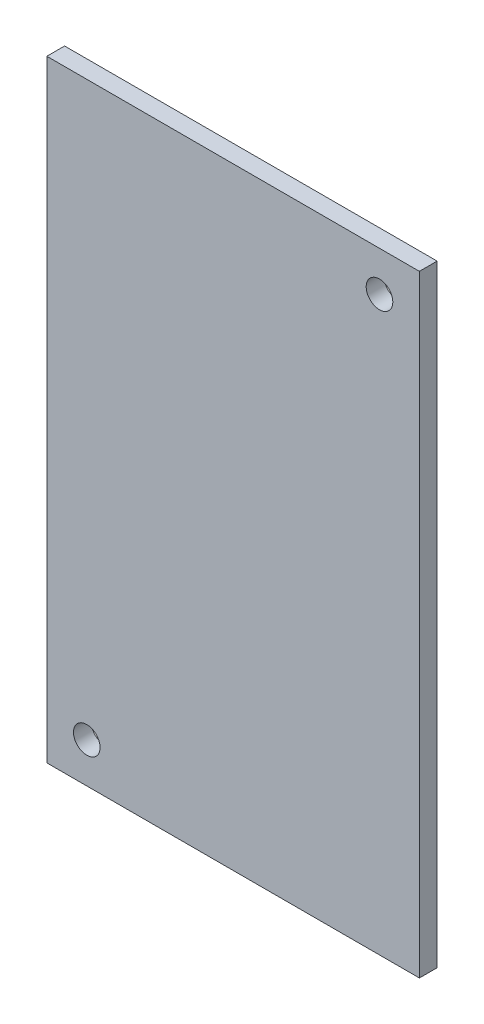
ISO-10303-21;
HEADER;
FILE_DESCRIPTION(('STEP AP214'),'2;1');
FILE_NAME('part.step','',(''),(''),'','','');
FILE_SCHEMA(('AUTOMOTIVE_DESIGN { 1 0 10303 214 1 1 1 1 }'));
ENDSEC;
DATA;
#1=APPLICATION_CONTEXT('core data for automotive mechanical design processes');
#2=APPLICATION_PROTOCOL_DEFINITION('international standard','automotive_design',2000,#1);
#3=PRODUCT_CONTEXT('',#1,'mechanical');
#4=PRODUCT('Part','Part','',(#3));
#5=PRODUCT_RELATED_PRODUCT_CATEGORY('part','',(#4));
#6=PRODUCT_DEFINITION_FORMATION('','',#4);
#7=PRODUCT_DEFINITION_CONTEXT('part definition',#1,'design');
#8=PRODUCT_DEFINITION('design','',#6,#7);
#9=PRODUCT_DEFINITION_SHAPE('','',#8);
#10=(LENGTH_UNIT() NAMED_UNIT(*) SI_UNIT(.MILLI.,.METRE.));
#11=(NAMED_UNIT(*) PLANE_ANGLE_UNIT() SI_UNIT($,.RADIAN.));
#12=(NAMED_UNIT(*) SI_UNIT($,.STERADIAN.) SOLID_ANGLE_UNIT());
#13=UNCERTAINTY_MEASURE_WITH_UNIT(LENGTH_MEASURE(1.E-05),#10,'distance_accuracy_value','');
#14=(GEOMETRIC_REPRESENTATION_CONTEXT(3) GLOBAL_UNCERTAINTY_ASSIGNED_CONTEXT((#13)) GLOBAL_UNIT_ASSIGNED_CONTEXT((#10,
#11,#12)) REPRESENTATION_CONTEXT('',''));
#15=CARTESIAN_POINT('',(0.,0.,0.));
#16=DIRECTION('',(0.,0.,1.));
#17=DIRECTION('',(1.,0.,0.));
#18=AXIS2_PLACEMENT_3D('',#15,#16,#17);
#19=CARTESIAN_POINT('',(0.,0.,61.1925663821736));
#20=DIRECTION('',(0.,0.,1.));
#21=DIRECTION('',(1.,0.,0.));
#22=AXIS2_PLACEMENT_3D('',#19,#20,#21);
#23=PLANE('',#22);
#24=CARTESIAN_POINT('',(58.9525591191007,33.6048244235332,61.1925663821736));
#25=DIRECTION('',(0.,0.,1.));
#26=DIRECTION('',(-1.,0.,0.));
#27=AXIS2_PLACEMENT_3D('',#24,#25,#26);
#28=CIRCLE('',#27,1.5);
#29=CARTESIAN_POINT('',(57.4525591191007,33.6048244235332,61.1925663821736));
#30=VERTEX_POINT('',#29);
#31=EDGE_CURVE('E100',#30,#30,#28,.T.);
#32=ORIENTED_EDGE('',*,*,#31,.F.);
#33=EDGE_LOOP('',(#32));
#34=FACE_BOUND('',#33,.T.);
#35=DIRECTION('',(0.,1.,0.));
#36=VECTOR('',#35,1.);
#37=CARTESIAN_POINT('',(96.4525591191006,98.1048244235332,61.1925663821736));
#38=LINE('',#37,#36);
#39=CARTESIAN_POINT('',(96.4525591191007,29.1048244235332,61.1925663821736));
#40=VERTEX_POINT('',#39);
#41=CARTESIAN_POINT('',(96.4525591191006,98.1048244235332,61.1925663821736));
#42=VERTEX_POINT('',#41);
#43=EDGE_CURVE('E85',#40,#42,#38,.T.);
#44=ORIENTED_EDGE('',*,*,#43,.T.);
#45=DIRECTION('',(-1.,0.,0.));
#46=VECTOR('',#45,1.);
#47=CARTESIAN_POINT('',(54.4525591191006,98.1048244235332,61.1925663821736));
#48=LINE('',#47,#46);
#49=CARTESIAN_POINT('',(54.4525591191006,98.1048244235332,61.1925663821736));
#50=VERTEX_POINT('',#49);
#51=EDGE_CURVE('E80',#42,#50,#48,.T.);
#52=ORIENTED_EDGE('',*,*,#51,.T.);
#53=DIRECTION('',(0.,-1.,0.));
#54=VECTOR('',#53,1.);
#55=CARTESIAN_POINT('',(54.4525591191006,98.1048244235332,61.1925663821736));
#56=LINE('',#55,#54);
#57=CARTESIAN_POINT('',(54.4525591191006,29.1048244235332,61.1925663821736));
#58=VERTEX_POINT('',#57);
#59=EDGE_CURVE('E83',#50,#58,#56,.T.);
#60=ORIENTED_EDGE('',*,*,#59,.T.);
#61=DIRECTION('',(1.,0.,0.));
#62=VECTOR('',#61,1.);
#63=CARTESIAN_POINT('',(54.4525591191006,29.1048244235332,61.1925663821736));
#64=LINE('',#63,#62);
#65=EDGE_CURVE('E50',#58,#40,#64,.T.);
#66=ORIENTED_EDGE('',*,*,#65,.T.);
#67=EDGE_LOOP('',(#44,#52,#60,#66));
#68=FACE_BOUND('',#67,.T.);
#69=CARTESIAN_POINT('',(91.9525591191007,93.6048244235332,61.1925663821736));
#70=DIRECTION('',(0.,0.,1.));
#71=DIRECTION('',(-1.,0.,0.));
#72=AXIS2_PLACEMENT_3D('',#69,#70,#71);
#73=CIRCLE('',#72,1.5);
#74=CARTESIAN_POINT('',(90.4525591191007,93.6048244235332,61.1925663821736));
#75=VERTEX_POINT('',#74);
#76=EDGE_CURVE('E115',#75,#75,#73,.T.);
#77=ORIENTED_EDGE('',*,*,#76,.F.);
#78=EDGE_LOOP('',(#77));
#79=FACE_BOUND('',#78,.T.);
#80=ADVANCED_FACE('F33',(#34,#68,#79),#23,.T.);
#81=CARTESIAN_POINT('',(0.,0.,59.1925663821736));
#82=DIRECTION('',(0.,0.,1.));
#83=DIRECTION('',(1.,0.,0.));
#84=AXIS2_PLACEMENT_3D('',#81,#82,#83);
#85=PLANE('',#84);
#86=DIRECTION('',(0.,1.,0.));
#87=VECTOR('',#86,1.);
#88=CARTESIAN_POINT('',(96.4525591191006,98.1048244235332,59.1925663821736));
#89=LINE('',#88,#87);
#90=CARTESIAN_POINT('',(96.4525591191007,29.1048244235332,59.1925663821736));
#91=VERTEX_POINT('',#90);
#92=CARTESIAN_POINT('',(96.4525591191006,98.1048244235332,59.1925663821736));
#93=VERTEX_POINT('',#92);
#94=EDGE_CURVE('E97',#91,#93,#89,.T.);
#95=ORIENTED_EDGE('',*,*,#94,.F.);
#96=DIRECTION('',(1.,0.,0.));
#97=VECTOR('',#96,1.);
#98=CARTESIAN_POINT('',(54.4525591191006,29.1048244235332,59.1925663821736));
#99=LINE('',#98,#97);
#100=CARTESIAN_POINT('',(54.4525591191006,29.1048244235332,59.1925663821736));
#101=VERTEX_POINT('',#100);
#102=EDGE_CURVE('E73',#101,#91,#99,.T.);
#103=ORIENTED_EDGE('',*,*,#102,.F.);
#104=DIRECTION('',(0.,-1.,0.));
#105=VECTOR('',#104,1.);
#106=CARTESIAN_POINT('',(54.4525591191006,98.1048244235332,59.1925663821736));
#107=LINE('',#106,#105);
#108=CARTESIAN_POINT('',(54.4525591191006,98.1048244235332,59.1925663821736));
#109=VERTEX_POINT('',#108);
#110=EDGE_CURVE('E67',#109,#101,#107,.T.);
#111=ORIENTED_EDGE('',*,*,#110,.F.);
#112=DIRECTION('',(-1.,0.,0.));
#113=VECTOR('',#112,1.);
#114=CARTESIAN_POINT('',(54.4525591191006,98.1048244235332,59.1925663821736));
#115=LINE('',#114,#113);
#116=EDGE_CURVE('E89',#93,#109,#115,.T.);
#117=ORIENTED_EDGE('',*,*,#116,.F.);
#118=EDGE_LOOP('',(#95,#103,#111,#117));
#119=FACE_BOUND('',#118,.T.);
#120=CARTESIAN_POINT('',(58.9525591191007,33.6048244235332,59.1925663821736));
#121=DIRECTION('',(0.,0.,1.));
#122=DIRECTION('',(-1.,0.,0.));
#123=AXIS2_PLACEMENT_3D('',#120,#121,#122);
#124=CIRCLE('',#123,1.5);
#125=CARTESIAN_POINT('',(57.4525591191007,33.6048244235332,59.1925663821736));
#126=VERTEX_POINT('',#125);
#127=EDGE_CURVE('E112',#126,#126,#124,.T.);
#128=ORIENTED_EDGE('',*,*,#127,.T.);
#129=EDGE_LOOP('',(#128));
#130=FACE_BOUND('',#129,.T.);
#131=CARTESIAN_POINT('',(91.9525591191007,93.6048244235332,59.1925663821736));
#132=DIRECTION('',(0.,0.,1.));
#133=DIRECTION('',(-1.,0.,0.));
#134=AXIS2_PLACEMENT_3D('',#131,#132,#133);
#135=CIRCLE('',#134,1.5);
#136=CARTESIAN_POINT('',(90.4525591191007,93.6048244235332,59.1925663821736));
#137=VERTEX_POINT('',#136);
#138=EDGE_CURVE('E118',#137,#137,#135,.T.);
#139=ORIENTED_EDGE('',*,*,#138,.T.);
#140=EDGE_LOOP('',(#139));
#141=FACE_BOUND('',#140,.T.);
#142=ADVANCED_FACE('F108',(#119,#130,#141),#85,.F.);
#143=CARTESIAN_POINT('',(96.4525591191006,98.1048244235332,61.1925663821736));
#144=DIRECTION('',(-1.,0.,0.));
#145=DIRECTION('',(0.,-1.,0.));
#146=AXIS2_PLACEMENT_3D('',#143,#144,#145);
#147=PLANE('',#146);
#148=ORIENTED_EDGE('',*,*,#94,.T.);
#149=DIRECTION('',(0.,0.,-1.));
#150=VECTOR('',#149,1.);
#151=CARTESIAN_POINT('',(96.4525591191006,98.1048244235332,61.1925663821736));
#152=LINE('',#151,#150);
#153=EDGE_CURVE('E11',#42,#93,#152,.T.);
#154=ORIENTED_EDGE('',*,*,#153,.F.);
#155=ORIENTED_EDGE('',*,*,#43,.F.);
#156=DIRECTION('',(0.,0.,-1.));
#157=VECTOR('',#156,1.);
#158=CARTESIAN_POINT('',(96.4525591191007,29.1048244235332,61.1925663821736));
#159=LINE('',#158,#157);
#160=EDGE_CURVE('E93',#40,#91,#159,.T.);
#161=ORIENTED_EDGE('',*,*,#160,.T.);
#162=EDGE_LOOP('',(#148,#154,#155,#161));
#163=FACE_BOUND('',#162,.T.);
#164=ADVANCED_FACE('F35',(#163),#147,.F.);
#165=CARTESIAN_POINT('',(54.4525591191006,98.1048244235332,61.1925663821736));
#166=DIRECTION('',(0.,-1.,0.));
#167=DIRECTION('',(0.,0.,-1.));
#168=AXIS2_PLACEMENT_3D('',#165,#166,#167);
#169=PLANE('',#168);
#170=ORIENTED_EDGE('',*,*,#116,.T.);
#171=DIRECTION('',(0.,0.,-1.));
#172=VECTOR('',#171,1.);
#173=CARTESIAN_POINT('',(54.4525591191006,98.1048244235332,61.1925663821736));
#174=LINE('',#173,#172);
#175=EDGE_CURVE('E42',#50,#109,#174,.T.);
#176=ORIENTED_EDGE('',*,*,#175,.F.);
#177=ORIENTED_EDGE('',*,*,#51,.F.);
#178=ORIENTED_EDGE('',*,*,#153,.T.);
#179=EDGE_LOOP('',(#170,#176,#177,#178));
#180=FACE_BOUND('',#179,.T.);
#181=ADVANCED_FACE('F88',(#180),#169,.F.);
#182=CARTESIAN_POINT('',(54.4525591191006,98.1048244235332,61.1925663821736));
#183=DIRECTION('',(1.,0.,0.));
#184=DIRECTION('',(0.,0.,-1.));
#185=AXIS2_PLACEMENT_3D('',#182,#183,#184);
#186=PLANE('',#185);
#187=ORIENTED_EDGE('',*,*,#110,.T.);
#188=DIRECTION('',(0.,0.,-1.));
#189=VECTOR('',#188,1.);
#190=CARTESIAN_POINT('',(54.4525591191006,29.1048244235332,61.1925663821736));
#191=LINE('',#190,#189);
#192=EDGE_CURVE('E90',#58,#101,#191,.T.);
#193=ORIENTED_EDGE('',*,*,#192,.F.);
#194=ORIENTED_EDGE('',*,*,#59,.F.);
#195=ORIENTED_EDGE('',*,*,#175,.T.);
#196=EDGE_LOOP('',(#187,#193,#194,#195));
#197=FACE_BOUND('',#196,.T.);
#198=ADVANCED_FACE('F91',(#197),#186,.F.);
#199=CARTESIAN_POINT('',(54.4525591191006,29.1048244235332,61.1925663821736));
#200=DIRECTION('',(0.,1.,0.));
#201=DIRECTION('',(0.,0.,1.));
#202=AXIS2_PLACEMENT_3D('',#199,#200,#201);
#203=PLANE('',#202);
#204=ORIENTED_EDGE('',*,*,#102,.T.);
#205=ORIENTED_EDGE('',*,*,#160,.F.);
#206=ORIENTED_EDGE('',*,*,#65,.F.);
#207=ORIENTED_EDGE('',*,*,#192,.T.);
#208=EDGE_LOOP('',(#204,#205,#206,#207));
#209=FACE_BOUND('',#208,.T.);
#210=ADVANCED_FACE('F105',(#209),#203,.F.);
#211=CARTESIAN_POINT('',(58.9525591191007,33.6048244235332,61.1925663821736));
#212=DIRECTION('',(0.,0.,-1.));
#213=DIRECTION('',(-1.,0.,0.));
#214=AXIS2_PLACEMENT_3D('',#211,#212,#213);
#215=CYLINDRICAL_SURFACE('',#214,1.5);
#216=ORIENTED_EDGE('',*,*,#31,.T.);
#217=EDGE_LOOP('',(#216));
#218=FACE_BOUND('',#217,.T.);
#219=ORIENTED_EDGE('',*,*,#127,.F.);
#220=EDGE_LOOP('',(#219));
#221=FACE_BOUND('',#220,.T.);
#222=ADVANCED_FACE('F135',(#218,#221),#215,.F.);
#223=CARTESIAN_POINT('',(91.9525591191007,93.6048244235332,61.1925663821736));
#224=DIRECTION('',(0.,0.,-1.));
#225=DIRECTION('',(-1.,0.,0.));
#226=AXIS2_PLACEMENT_3D('',#223,#224,#225);
#227=CYLINDRICAL_SURFACE('',#226,1.5);
#228=ORIENTED_EDGE('',*,*,#76,.T.);
#229=EDGE_LOOP('',(#228));
#230=FACE_BOUND('',#229,.T.);
#231=ORIENTED_EDGE('',*,*,#138,.F.);
#232=EDGE_LOOP('',(#231));
#233=FACE_BOUND('',#232,.T.);
#234=ADVANCED_FACE('F124',(#230,#233),#227,.F.);
#235=CLOSED_SHELL('',(#80,#142,#164,#181,#198,#210,#222,#234));
#236=MANIFOLD_SOLID_BREP('B2',#235);
#237=ADVANCED_BREP_SHAPE_REPRESENTATION('',(#18,#236),#14);
#238=SHAPE_DEFINITION_REPRESENTATION(#9,#237);
ENDSEC;
END-ISO-10303-21;
